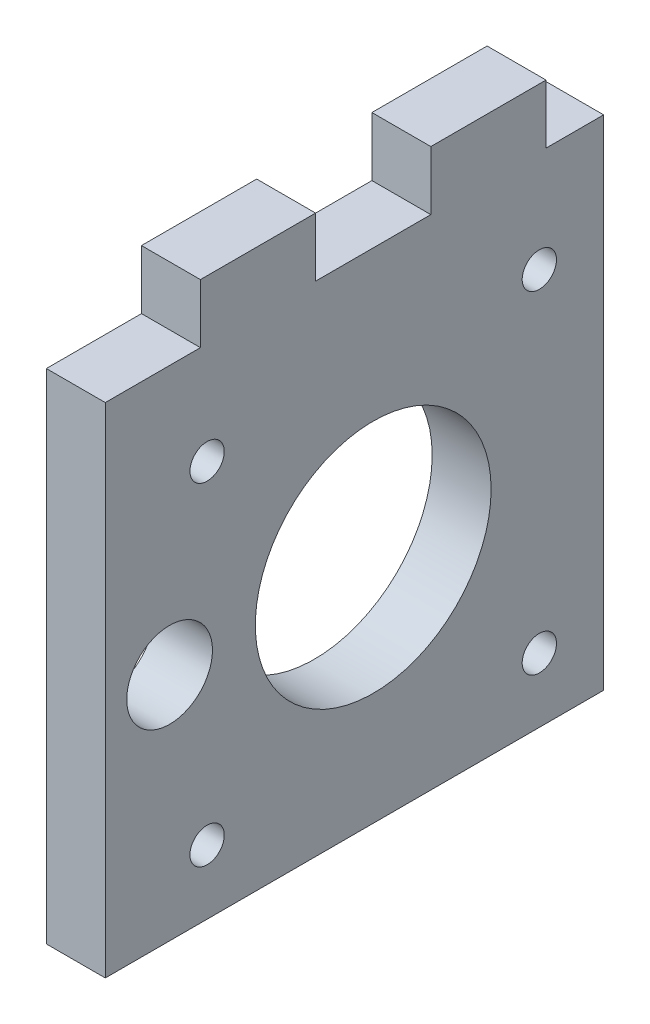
from build123d import *

# Parameters (mm, degrees)
SKETCH2_R           = 11
SKETCH2_R_2         = 1.6
SKETCH2_R_3         = 4
BOSS_EXTRUDE2_DEPTH = 5.5


with BuildPart() as part:
    # Sketch2 → Boss-Extrude2 (new body)
    with BuildSketch(Plane(origin=(0, 0, 0), x_dir=(0, 0, -1), z_dir=(1, 0, 0))):
        Polygon((-43, 0), (0, 0), (0, 46.5), (-5.375, 46.5), (-5.375, 52), (-16.125, 52), (-16.125, 46.5), (-26.875, 46.5), (-26.875, 52), (-37.625, 52), (-37.625, 46.5), (-46.5, 46.5), (-46.5, 0), align=None)
        with Locations((-21.5, 21.5)):
            Circle(SKETCH2_R, mode=Mode.SUBTRACT)
        with Locations((-6, 37)):
            Circle(SKETCH2_R_2, mode=Mode.SUBTRACT)
        with Locations((-6, 6)):
            Circle(SKETCH2_R_2, mode=Mode.SUBTRACT)
        with Locations((-37, 6)):
            Circle(SKETCH2_R_2, mode=Mode.SUBTRACT)
        with Locations((-37, 37)):
            Circle(SKETCH2_R_2, mode=Mode.SUBTRACT)
        with Locations((-40.5, 21.5)):
            Circle(SKETCH2_R_3, mode=Mode.SUBTRACT)
    extrude(amount=BOSS_EXTRUDE2_DEPTH)


solid = part.part
